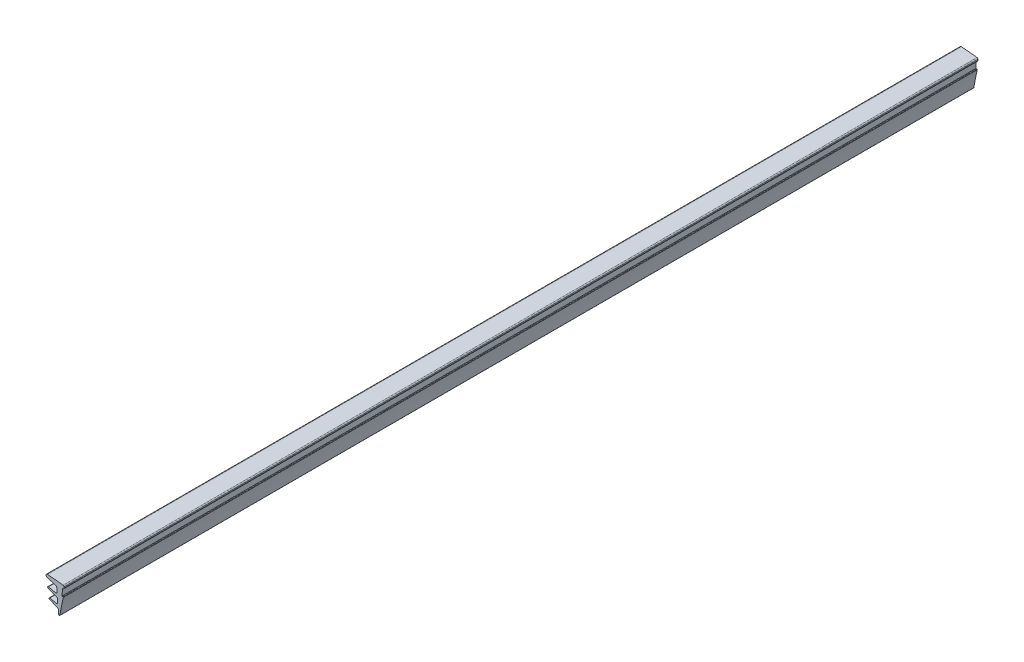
ISO-10303-21;
HEADER;
FILE_DESCRIPTION(('STEP AP214'),'2;1');
FILE_NAME('part.step','',(''),(''),'','','');
FILE_SCHEMA(('AUTOMOTIVE_DESIGN { 1 0 10303 214 1 1 1 1 }'));
ENDSEC;
DATA;
#1=APPLICATION_CONTEXT('core data for automotive mechanical design processes');
#2=APPLICATION_PROTOCOL_DEFINITION('international standard','automotive_design',2000,#1);
#3=PRODUCT_CONTEXT('',#1,'mechanical');
#4=PRODUCT('Part','Part','',(#3));
#5=PRODUCT_RELATED_PRODUCT_CATEGORY('part','',(#4));
#6=PRODUCT_DEFINITION_FORMATION('','',#4);
#7=PRODUCT_DEFINITION_CONTEXT('part definition',#1,'design');
#8=PRODUCT_DEFINITION('design','',#6,#7);
#9=PRODUCT_DEFINITION_SHAPE('','',#8);
#10=(LENGTH_UNIT() NAMED_UNIT(*) SI_UNIT(.MILLI.,.METRE.));
#11=(NAMED_UNIT(*) PLANE_ANGLE_UNIT() SI_UNIT($,.RADIAN.));
#12=(NAMED_UNIT(*) SI_UNIT($,.STERADIAN.) SOLID_ANGLE_UNIT());
#13=UNCERTAINTY_MEASURE_WITH_UNIT(LENGTH_MEASURE(1.E-05),#10,'distance_accuracy_value','');
#14=(GEOMETRIC_REPRESENTATION_CONTEXT(3) GLOBAL_UNCERTAINTY_ASSIGNED_CONTEXT((#13)) GLOBAL_UNIT_ASSIGNED_CONTEXT((#10,
#11,#12)) REPRESENTATION_CONTEXT('',''));
#15=CARTESIAN_POINT('',(0.,0.,0.));
#16=DIRECTION('',(0.,0.,1.));
#17=DIRECTION('',(1.,0.,0.));
#18=AXIS2_PLACEMENT_3D('',#15,#16,#17);
#19=CARTESIAN_POINT('',(2.32651293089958,2.35302451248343,-300.));
#20=DIRECTION('',(0.,0.,1.));
#21=DIRECTION('',(1.,0.,0.));
#22=AXIS2_PLACEMENT_3D('',#19,#20,#21);
#23=CYLINDRICAL_SURFACE('',#22,0.349999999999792);
#24=CARTESIAN_POINT('',(2.32651293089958,2.35302451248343,0.));
#25=DIRECTION('',(0.,0.,1.));
#26=DIRECTION('',(1.,0.,0.));
#27=AXIS2_PLACEMENT_3D('',#24,#25,#26);
#28=CIRCLE('',#27,0.349999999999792);
#29=CARTESIAN_POINT('',(2.37536265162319,2.00645027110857,0.));
#30=VERTEX_POINT('',#29);
#31=CARTESIAN_POINT('',(2.67607026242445,2.33542701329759,0.));
#32=VERTEX_POINT('',#31);
#33=EDGE_CURVE('E254',#30,#32,#28,.T.);
#34=ORIENTED_EDGE('',*,*,#33,.F.);
#35=DIRECTION('',(0.,0.,1.));
#36=VECTOR('',#35,1.);
#37=CARTESIAN_POINT('',(2.37536265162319,2.00645027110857,-300.));
#38=LINE('',#37,#36);
#39=CARTESIAN_POINT('',(2.37536265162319,2.00645027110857,-300.));
#40=VERTEX_POINT('',#39);
#41=EDGE_CURVE('E11',#40,#30,#38,.T.);
#42=ORIENTED_EDGE('',*,*,#41,.F.);
#43=CARTESIAN_POINT('',(2.32651293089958,2.35302451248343,-300.));
#44=DIRECTION('',(0.,0.,1.));
#45=DIRECTION('',(1.,0.,0.));
#46=AXIS2_PLACEMENT_3D('',#43,#44,#45);
#47=CIRCLE('',#46,0.349999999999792);
#48=CARTESIAN_POINT('',(2.67607026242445,2.33542701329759,-300.));
#49=VERTEX_POINT('',#48);
#50=EDGE_CURVE('E334',#40,#49,#47,.T.);
#51=ORIENTED_EDGE('',*,*,#50,.T.);
#52=DIRECTION('',(0.,0.,1.));
#53=VECTOR('',#52,1.);
#54=CARTESIAN_POINT('',(2.67607026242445,2.33542701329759,-300.));
#55=LINE('',#54,#53);
#56=EDGE_CURVE('E40',#49,#32,#55,.T.);
#57=ORIENTED_EDGE('',*,*,#56,.T.);
#58=EDGE_LOOP('',(#34,#42,#51,#57));
#59=FACE_BOUND('',#58,.T.);
#60=ADVANCED_FACE('F37',(#59),#23,.T.);
#61=CARTESIAN_POINT('',(2.34520814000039,2.00219998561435,-300.));
#62=DIRECTION('',(0.139570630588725,-0.990212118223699,0.));
#63=DIRECTION('',(0.9902121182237,0.139570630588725,0.));
#64=AXIS2_PLACEMENT_3D('',#61,#62,#63);
#65=PLANE('',#64);
#66=DIRECTION('',(0.990212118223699,0.139570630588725,0.));
#67=VECTOR('',#66,1.);
#68=CARTESIAN_POINT('',(2.34520814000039,2.00219998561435,0.));
#69=LINE('',#68,#67);
#70=CARTESIAN_POINT('',(2.34520814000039,2.00219998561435,0.));
#71=VERTEX_POINT('',#70);
#72=EDGE_CURVE('E332',#71,#30,#69,.T.);
#73=ORIENTED_EDGE('',*,*,#72,.F.);
#74=DIRECTION('',(0.,0.,1.));
#75=VECTOR('',#74,1.);
#76=CARTESIAN_POINT('',(2.34520814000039,2.00219998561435,-300.));
#77=LINE('',#76,#75);
#78=CARTESIAN_POINT('',(2.34520814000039,2.00219998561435,-300.));
#79=VERTEX_POINT('',#78);
#80=EDGE_CURVE('E46',#79,#71,#77,.T.);
#81=ORIENTED_EDGE('',*,*,#80,.F.);
#82=DIRECTION('',(0.990212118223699,0.139570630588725,0.));
#83=VECTOR('',#82,1.);
#84=CARTESIAN_POINT('',(2.34520814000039,2.00219998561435,-300.));
#85=LINE('',#84,#83);
#86=EDGE_CURVE('E244',#79,#40,#85,.T.);
#87=ORIENTED_EDGE('',*,*,#86,.T.);
#88=ORIENTED_EDGE('',*,*,#41,.T.);
#89=EDGE_LOOP('',(#73,#81,#87,#88));
#90=FACE_BOUND('',#89,.T.);
#91=ADVANCED_FACE('F386',(#90),#65,.T.);
#92=CARTESIAN_POINT('',(2.38010079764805,1.7546469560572,-300.));
#93=DIRECTION('',(0.,0.,1.));
#94=DIRECTION('',(1.,0.,0.));
#95=AXIS2_PLACEMENT_3D('',#92,#93,#94);
#96=CYLINDRICAL_SURFACE('',#95,0.250000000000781);
#97=CARTESIAN_POINT('',(2.38010079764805,1.7546469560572,0.));
#98=DIRECTION('',(0.,0.,-1.));
#99=DIRECTION('',(1.,0.,0.));
#100=AXIS2_PLACEMENT_3D('',#97,#98,#99);
#101=CIRCLE('',#100,0.250000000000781);
#102=CARTESIAN_POINT('',(2.13024308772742,1.76308050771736,0.));
#103=VERTEX_POINT('',#102);
#104=EDGE_CURVE('E231',#103,#71,#101,.T.);
#105=ORIENTED_EDGE('',*,*,#104,.F.);
#106=DIRECTION('',(0.,0.,1.));
#107=VECTOR('',#106,1.);
#108=CARTESIAN_POINT('',(2.13024308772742,1.76308050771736,-300.));
#109=LINE('',#108,#107);
#110=CARTESIAN_POINT('',(2.13024308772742,1.76308050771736,-300.));
#111=VERTEX_POINT('',#110);
#112=EDGE_CURVE('E226',#111,#103,#109,.T.);
#113=ORIENTED_EDGE('',*,*,#112,.F.);
#114=CARTESIAN_POINT('',(2.38010079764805,1.7546469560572,-300.));
#115=DIRECTION('',(0.,0.,-1.));
#116=DIRECTION('',(1.,0.,0.));
#117=AXIS2_PLACEMENT_3D('',#114,#115,#116);
#118=CIRCLE('',#117,0.250000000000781);
#119=EDGE_CURVE('E229',#111,#79,#118,.T.);
#120=ORIENTED_EDGE('',*,*,#119,.T.);
#121=ORIENTED_EDGE('',*,*,#80,.T.);
#122=EDGE_LOOP('',(#105,#113,#120,#121));
#123=FACE_BOUND('',#122,.T.);
#124=ADVANCED_FACE('F228',(#123),#96,.F.);
#125=CARTESIAN_POINT('',(2.06454579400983,-0.183308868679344,-300.));
#126=DIRECTION('',(0.999430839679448,-0.0337342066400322,0.));
#127=DIRECTION('',(0.0337342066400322,0.999430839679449,0.));
#128=AXIS2_PLACEMENT_3D('',#125,#126,#127);
#129=PLANE('',#128);
#130=DIRECTION('',(0.0337342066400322,0.999430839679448,0.));
#131=VECTOR('',#130,1.);
#132=CARTESIAN_POINT('',(2.06454579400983,-0.183308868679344,0.));
#133=LINE('',#132,#131);
#134=CARTESIAN_POINT('',(2.06454579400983,-0.183308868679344,0.));
#135=VERTEX_POINT('',#134);
#136=EDGE_CURVE('E329',#135,#103,#133,.T.);
#137=ORIENTED_EDGE('',*,*,#136,.F.);
#138=DIRECTION('',(0.,0.,1.));
#139=VECTOR('',#138,1.);
#140=CARTESIAN_POINT('',(2.06454579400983,-0.183308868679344,-300.));
#141=LINE('',#140,#139);
#142=CARTESIAN_POINT('',(2.06454579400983,-0.183308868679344,-300.));
#143=VERTEX_POINT('',#142);
#144=EDGE_CURVE('E236',#143,#135,#141,.T.);
#145=ORIENTED_EDGE('',*,*,#144,.F.);
#146=DIRECTION('',(0.0337342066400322,0.999430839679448,0.));
#147=VECTOR('',#146,1.);
#148=CARTESIAN_POINT('',(2.06454579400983,-0.183308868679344,-300.));
#149=LINE('',#148,#147);
#150=EDGE_CURVE('E242',#143,#111,#149,.T.);
#151=ORIENTED_EDGE('',*,*,#150,.T.);
#152=ORIENTED_EDGE('',*,*,#112,.T.);
#153=EDGE_LOOP('',(#137,#145,#151,#152));
#154=FACE_BOUND('',#153,.T.);
#155=ADVANCED_FACE('F246',(#154),#129,.T.);
#156=CARTESIAN_POINT('',(2.16448887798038,-0.186682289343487,-300.));
#157=DIRECTION('',(0.,0.,1.));
#158=DIRECTION('',(1.,0.,0.));
#159=AXIS2_PLACEMENT_3D('',#156,#157,#158);
#160=CYLINDRICAL_SURFACE('',#159,0.100000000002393);
#161=CARTESIAN_POINT('',(2.16448887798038,-0.186682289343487,0.));
#162=DIRECTION('',(0.,0.,-1.));
#163=DIRECTION('',(1.,0.,0.));
#164=AXIS2_PLACEMENT_3D('',#161,#162,#163);
#165=CIRCLE('',#164,0.100000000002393);
#166=CARTESIAN_POINT('',(2.16646422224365,-0.286662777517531,0.));
#167=VERTEX_POINT('',#166);
#168=EDGE_CURVE('E326',#167,#135,#165,.T.);
#169=ORIENTED_EDGE('',*,*,#168,.F.);
#170=DIRECTION('',(0.,0.,1.));
#171=VECTOR('',#170,1.);
#172=CARTESIAN_POINT('',(2.16646422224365,-0.286662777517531,-300.));
#173=LINE('',#172,#171);
#174=CARTESIAN_POINT('',(2.16646422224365,-0.286662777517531,-300.));
#175=VERTEX_POINT('',#174);
#176=EDGE_CURVE('E338',#175,#167,#173,.T.);
#177=ORIENTED_EDGE('',*,*,#176,.F.);
#178=CARTESIAN_POINT('',(2.16448887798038,-0.186682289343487,-300.));
#179=DIRECTION('',(0.,0.,-1.));
#180=DIRECTION('',(1.,0.,0.));
#181=AXIS2_PLACEMENT_3D('',#178,#179,#180);
#182=CIRCLE('',#181,0.100000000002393);
#183=EDGE_CURVE('E247',#175,#143,#182,.T.);
#184=ORIENTED_EDGE('',*,*,#183,.T.);
#185=ORIENTED_EDGE('',*,*,#144,.T.);
#186=EDGE_LOOP('',(#169,#177,#184,#185));
#187=FACE_BOUND('',#186,.T.);
#188=ADVANCED_FACE('F399',(#187),#160,.F.);
#189=CARTESIAN_POINT('',(2.36575350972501,-0.282725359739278,-300.));
#190=DIRECTION('',(-0.0197534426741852,0.999804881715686,0.));
#191=DIRECTION('',(-0.999804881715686,-0.0197534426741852,0.));
#192=AXIS2_PLACEMENT_3D('',#189,#190,#191);
#193=PLANE('',#192);
#194=DIRECTION('',(-0.999804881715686,-0.0197534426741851,0.));
#195=VECTOR('',#194,1.);
#196=CARTESIAN_POINT('',(2.36575350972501,-0.282725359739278,0.));
#197=LINE('',#196,#195);
#198=CARTESIAN_POINT('',(2.36575350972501,-0.282725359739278,0.));
#199=VERTEX_POINT('',#198);
#200=EDGE_CURVE('E323',#199,#167,#197,.T.);
#201=ORIENTED_EDGE('',*,*,#200,.F.);
#202=DIRECTION('',(0.,0.,1.));
#203=VECTOR('',#202,1.);
#204=CARTESIAN_POINT('',(2.36575350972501,-0.282725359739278,-300.));
#205=LINE('',#204,#203);
#206=CARTESIAN_POINT('',(2.36575350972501,-0.282725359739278,-300.));
#207=VERTEX_POINT('',#206);
#208=EDGE_CURVE('E340',#207,#199,#205,.T.);
#209=ORIENTED_EDGE('',*,*,#208,.F.);
#210=DIRECTION('',(-0.999804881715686,-0.0197534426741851,0.));
#211=VECTOR('',#210,1.);
#212=CARTESIAN_POINT('',(2.36575350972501,-0.282725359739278,-300.));
#213=LINE('',#212,#211);
#214=EDGE_CURVE('E249',#207,#175,#213,.T.);
#215=ORIENTED_EDGE('',*,*,#214,.T.);
#216=ORIENTED_EDGE('',*,*,#176,.T.);
#217=EDGE_LOOP('',(#201,#209,#215,#216));
#218=FACE_BOUND('',#217,.T.);
#219=ADVANCED_FACE('F402',(#218),#193,.T.);
#220=CARTESIAN_POINT('',(2.36772885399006,-0.382705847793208,-300.));
#221=DIRECTION('',(0.,0.,1.));
#222=DIRECTION('',(1.,0.,0.));
#223=AXIS2_PLACEMENT_3D('',#220,#221,#222);
#224=CYLINDRICAL_SURFACE('',#223,0.0999999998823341);
#225=CARTESIAN_POINT('',(2.36772885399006,-0.382705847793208,0.));
#226=DIRECTION('',(0.,0.,1.));
#227=DIRECTION('',(1.,0.,0.));
#228=AXIS2_PLACEMENT_3D('',#225,#226,#227);
#229=CIRCLE('',#228,0.0999999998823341);
#230=CARTESIAN_POINT('',(2.46747341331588,-0.38984887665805,0.));
#231=VERTEX_POINT('',#230);
#232=EDGE_CURVE('E320',#231,#199,#229,.T.);
#233=ORIENTED_EDGE('',*,*,#232,.F.);
#234=DIRECTION('',(0.,0.,1.));
#235=VECTOR('',#234,1.);
#236=CARTESIAN_POINT('',(2.46747341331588,-0.38984887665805,-300.));
#237=LINE('',#236,#235);
#238=CARTESIAN_POINT('',(2.46747341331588,-0.38984887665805,-300.));
#239=VERTEX_POINT('',#238);
#240=EDGE_CURVE('E342',#239,#231,#237,.T.);
#241=ORIENTED_EDGE('',*,*,#240,.F.);
#242=CARTESIAN_POINT('',(2.36772885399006,-0.382705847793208,-300.));
#243=DIRECTION('',(0.,0.,1.));
#244=DIRECTION('',(1.,0.,0.));
#245=AXIS2_PLACEMENT_3D('',#242,#243,#244);
#246=CIRCLE('',#245,0.0999999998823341);
#247=EDGE_CURVE('E747',#239,#207,#246,.T.);
#248=ORIENTED_EDGE('',*,*,#247,.T.);
#249=ORIENTED_EDGE('',*,*,#208,.T.);
#250=EDGE_LOOP('',(#233,#241,#248,#249));
#251=FACE_BOUND('',#250,.T.);
#252=ADVANCED_FACE('F406',(#251),#224,.T.);
#253=CARTESIAN_POINT('',(118.333943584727,-26.9163243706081,-300.));
#254=DIRECTION('',(0.,0.,1.));
#255=DIRECTION('',(1.,0.,0.));
#256=AXIS2_PLACEMENT_3D('',#253,#254,#255);
#257=CYLINDRICAL_SURFACE('',#256,118.864178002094);
#258=CARTESIAN_POINT('',(118.333943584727,-26.9163243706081,0.));
#259=DIRECTION('',(0.,0.,-1.));
#260=DIRECTION('',(1.,0.,0.));
#261=AXIS2_PLACEMENT_3D('',#258,#259,#260);
#262=CIRCLE('',#261,118.864178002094);
#263=CARTESIAN_POINT('',(1.30619951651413,-6.10286885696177,0.));
#264=VERTEX_POINT('',#263);
#265=EDGE_CURVE('E317',#264,#231,#262,.T.);
#266=ORIENTED_EDGE('',*,*,#265,.F.);
#267=DIRECTION('',(0.,0.,1.));
#268=VECTOR('',#267,1.);
#269=CARTESIAN_POINT('',(1.30619951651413,-6.10286885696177,-300.));
#270=LINE('',#269,#268);
#271=CARTESIAN_POINT('',(1.30619951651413,-6.10286885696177,-300.));
#272=VERTEX_POINT('',#271);
#273=EDGE_CURVE('E344',#272,#264,#270,.T.);
#274=ORIENTED_EDGE('',*,*,#273,.F.);
#275=CARTESIAN_POINT('',(118.333943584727,-26.9163243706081,-300.));
#276=DIRECTION('',(0.,0.,-1.));
#277=DIRECTION('',(1.,0.,0.));
#278=AXIS2_PLACEMENT_3D('',#275,#276,#277);
#279=CIRCLE('',#278,118.864178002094);
#280=EDGE_CURVE('E743',#272,#239,#279,.T.);
#281=ORIENTED_EDGE('',*,*,#280,.T.);
#282=ORIENTED_EDGE('',*,*,#240,.T.);
#283=EDGE_LOOP('',(#266,#274,#281,#282));
#284=FACE_BOUND('',#283,.T.);
#285=ADVANCED_FACE('F410',(#284),#257,.F.);
#286=CARTESIAN_POINT('',(1.12569486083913,-6.01674064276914,-300.));
#287=DIRECTION('',(0.,0.,1.));
#288=DIRECTION('',(1.,0.,0.));
#289=AXIS2_PLACEMENT_3D('',#286,#287,#288);
#290=CYLINDRICAL_SURFACE('',#289,0.200000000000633);
#291=CARTESIAN_POINT('',(1.12569486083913,-6.01674064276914,0.));
#292=DIRECTION('',(0.,0.,1.));
#293=DIRECTION('',(1.,0.,0.));
#294=AXIS2_PLACEMENT_3D('',#291,#292,#293);
#295=CIRCLE('',#294,0.200000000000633);
#296=CARTESIAN_POINT('',(0.926299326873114,-6.03227837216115,0.));
#297=VERTEX_POINT('',#296);
#298=EDGE_CURVE('E314',#297,#264,#295,.T.);
#299=ORIENTED_EDGE('',*,*,#298,.F.);
#300=DIRECTION('',(0.,0.,1.));
#301=VECTOR('',#300,1.);
#302=CARTESIAN_POINT('',(0.926299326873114,-6.03227837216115,-300.));
#303=LINE('',#302,#301);
#304=CARTESIAN_POINT('',(0.926299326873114,-6.03227837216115,-300.));
#305=VERTEX_POINT('',#304);
#306=EDGE_CURVE('E346',#305,#297,#303,.T.);
#307=ORIENTED_EDGE('',*,*,#306,.F.);
#308=CARTESIAN_POINT('',(1.12569486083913,-6.01674064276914,-300.));
#309=DIRECTION('',(0.,0.,1.));
#310=DIRECTION('',(1.,0.,0.));
#311=AXIS2_PLACEMENT_3D('',#308,#309,#310);
#312=CIRCLE('',#311,0.200000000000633);
#313=EDGE_CURVE('E754',#305,#272,#312,.T.);
#314=ORIENTED_EDGE('',*,*,#313,.T.);
#315=ORIENTED_EDGE('',*,*,#273,.T.);
#316=EDGE_LOOP('',(#299,#307,#314,#315));
#317=FACE_BOUND('',#316,.T.);
#318=ADVANCED_FACE('F414',(#317),#290,.T.);
#319=CARTESIAN_POINT('',(0.818437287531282,-4.64808584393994,-300.));
#320=DIRECTION('',(-0.996977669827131,-0.0776886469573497,0.));
#321=DIRECTION('',(0.0776886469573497,-0.996977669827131,0.));
#322=AXIS2_PLACEMENT_3D('',#319,#320,#321);
#323=PLANE('',#322);
#324=DIRECTION('',(0.0776886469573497,-0.996977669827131,0.));
#325=VECTOR('',#324,1.);
#326=CARTESIAN_POINT('',(0.818437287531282,-4.64808584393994,0.));
#327=LINE('',#326,#325);
#328=CARTESIAN_POINT('',(0.818437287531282,-4.64808584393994,0.));
#329=VERTEX_POINT('',#328);
#330=EDGE_CURVE('E311',#329,#297,#327,.T.);
#331=ORIENTED_EDGE('',*,*,#330,.F.);
#332=DIRECTION('',(0.,0.,1.));
#333=VECTOR('',#332,1.);
#334=CARTESIAN_POINT('',(0.818437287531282,-4.64808584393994,-300.));
#335=LINE('',#334,#333);
#336=CARTESIAN_POINT('',(0.818437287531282,-4.64808584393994,-300.));
#337=VERTEX_POINT('',#336);
#338=EDGE_CURVE('E348',#337,#329,#335,.T.);
#339=ORIENTED_EDGE('',*,*,#338,.F.);
#340=DIRECTION('',(0.0776886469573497,-0.996977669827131,0.));
#341=VECTOR('',#340,1.);
#342=CARTESIAN_POINT('',(0.818437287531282,-4.64808584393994,-300.));
#343=LINE('',#342,#341);
#344=EDGE_CURVE('E736',#337,#305,#343,.T.);
#345=ORIENTED_EDGE('',*,*,#344,.T.);
#346=ORIENTED_EDGE('',*,*,#306,.T.);
#347=EDGE_LOOP('',(#331,#339,#345,#346));
#348=FACE_BOUND('',#347,.T.);
#349=ADVANCED_FACE('F418',(#348),#323,.T.);
#350=CARTESIAN_POINT('',(0.419646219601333,-4.67916130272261,-300.));
#351=DIRECTION('',(0.,0.,1.));
#352=DIRECTION('',(1.,0.,0.));
#353=AXIS2_PLACEMENT_3D('',#350,#351,#352);
#354=CYLINDRICAL_SURFACE('',#353,0.399999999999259);
#355=CARTESIAN_POINT('',(0.419646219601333,-4.67916130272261,0.));
#356=DIRECTION('',(0.,0.,-1.));
#357=DIRECTION('',(1.,0.,0.));
#358=AXIS2_PLACEMENT_3D('',#355,#356,#357);
#359=CIRCLE('',#358,0.399999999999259);
#360=CARTESIAN_POINT('',(0.515751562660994,-4.29087820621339,0.));
#361=VERTEX_POINT('',#360);
#362=EDGE_CURVE('E308',#361,#329,#359,.T.);
#363=ORIENTED_EDGE('',*,*,#362,.F.);
#364=DIRECTION('',(0.,0.,1.));
#365=VECTOR('',#364,1.);
#366=CARTESIAN_POINT('',(0.515751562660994,-4.29087820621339,-300.));
#367=LINE('',#366,#365);
#368=CARTESIAN_POINT('',(0.515751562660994,-4.29087820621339,-300.));
#369=VERTEX_POINT('',#368);
#370=EDGE_CURVE('E350',#369,#361,#367,.T.);
#371=ORIENTED_EDGE('',*,*,#370,.F.);
#372=CARTESIAN_POINT('',(0.419646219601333,-4.67916130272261,-300.));
#373=DIRECTION('',(0.,0.,-1.));
#374=DIRECTION('',(1.,0.,0.));
#375=AXIS2_PLACEMENT_3D('',#372,#373,#374);
#376=CIRCLE('',#375,0.399999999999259);
#377=EDGE_CURVE('E732',#369,#337,#376,.T.);
#378=ORIENTED_EDGE('',*,*,#377,.T.);
#379=ORIENTED_EDGE('',*,*,#338,.T.);
#380=EDGE_LOOP('',(#363,#371,#378,#379));
#381=FACE_BOUND('',#380,.T.);
#382=ADVANCED_FACE('F422',(#381),#354,.F.);
#383=CARTESIAN_POINT('',(-2.07591233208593,-3.22775044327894,-300.));
#384=DIRECTION('',(-0.379520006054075,-0.925183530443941,0.));
#385=DIRECTION('',(0.925183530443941,-0.379520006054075,0.));
#386=AXIS2_PLACEMENT_3D('',#383,#384,#385);
#387=PLANE('',#386);
#388=DIRECTION('',(0.925183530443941,-0.379520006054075,0.));
#389=VECTOR('',#388,1.);
#390=CARTESIAN_POINT('',(-2.07591233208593,-3.22775044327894,0.));
#391=LINE('',#390,#389);
#392=CARTESIAN_POINT('',(-2.07591233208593,-3.22775044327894,0.));
#393=VERTEX_POINT('',#392);
#394=EDGE_CURVE('E305',#393,#361,#391,.T.);
#395=ORIENTED_EDGE('',*,*,#394,.F.);
#396=DIRECTION('',(0.,0.,1.));
#397=VECTOR('',#396,1.);
#398=CARTESIAN_POINT('',(-2.07591233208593,-3.22775044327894,-300.));
#399=LINE('',#398,#397);
#400=CARTESIAN_POINT('',(-2.07591233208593,-3.22775044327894,-300.));
#401=VERTEX_POINT('',#400);
#402=EDGE_CURVE('E352',#401,#393,#399,.T.);
#403=ORIENTED_EDGE('',*,*,#402,.F.);
#404=DIRECTION('',(0.925183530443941,-0.379520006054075,0.));
#405=VECTOR('',#404,1.);
#406=CARTESIAN_POINT('',(-2.07591233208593,-3.22775044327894,-300.));
#407=LINE('',#406,#405);
#408=EDGE_CURVE('E758',#401,#369,#407,.T.);
#409=ORIENTED_EDGE('',*,*,#408,.T.);
#410=ORIENTED_EDGE('',*,*,#370,.T.);
#411=EDGE_LOOP('',(#395,#403,#409,#410));
#412=FACE_BOUND('',#411,.T.);
#413=ADVANCED_FACE('F426',(#412),#387,.T.);
#414=CARTESIAN_POINT('',(-1.98103233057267,-2.99645456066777,-300.));
#415=DIRECTION('',(0.,0.,1.));
#416=DIRECTION('',(1.,0.,0.));
#417=AXIS2_PLACEMENT_3D('',#414,#415,#416);
#418=CYLINDRICAL_SURFACE('',#417,0.250000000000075);
#419=CARTESIAN_POINT('',(-1.98103233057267,-2.99645456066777,0.));
#420=DIRECTION('',(0.,0.,1.));
#421=DIRECTION('',(1.,0.,0.));
#422=AXIS2_PLACEMENT_3D('',#419,#420,#421);
#423=CIRCLE('',#422,0.250000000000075);
#424=CARTESIAN_POINT('',(-1.92096649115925,-2.75377762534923,0.));
#425=VERTEX_POINT('',#424);
#426=EDGE_CURVE('E302',#425,#393,#423,.T.);
#427=ORIENTED_EDGE('',*,*,#426,.F.);
#428=DIRECTION('',(0.,0.,1.));
#429=VECTOR('',#428,1.);
#430=CARTESIAN_POINT('',(-1.92096649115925,-2.75377762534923,-300.));
#431=LINE('',#430,#429);
#432=CARTESIAN_POINT('',(-1.92096649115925,-2.75377762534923,-300.));
#433=VERTEX_POINT('',#432);
#434=EDGE_CURVE('E354',#433,#425,#431,.T.);
#435=ORIENTED_EDGE('',*,*,#434,.F.);
#436=CARTESIAN_POINT('',(-1.98103233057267,-2.99645456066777,-300.));
#437=DIRECTION('',(0.,0.,1.));
#438=DIRECTION('',(1.,0.,0.));
#439=AXIS2_PLACEMENT_3D('',#436,#437,#438);
#440=CIRCLE('',#439,0.250000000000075);
#441=EDGE_CURVE('E725',#433,#401,#440,.T.);
#442=ORIENTED_EDGE('',*,*,#441,.T.);
#443=ORIENTED_EDGE('',*,*,#402,.T.);
#444=EDGE_LOOP('',(#427,#435,#442,#443));
#445=FACE_BOUND('',#444,.T.);
#446=ADVANCED_FACE('F430',(#445),#418,.T.);
#447=CARTESIAN_POINT('',(0.127737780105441,-3.26085977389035,-300.));
#448=DIRECTION('',(0.240263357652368,0.970707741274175,0.));
#449=DIRECTION('',(-0.970707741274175,0.240263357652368,0.));
#450=AXIS2_PLACEMENT_3D('',#447,#448,#449);
#451=PLANE('',#450);
#452=DIRECTION('',(-0.970707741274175,0.240263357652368,0.));
#453=VECTOR('',#452,1.);
#454=CARTESIAN_POINT('',(0.127737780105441,-3.26085977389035,0.));
#455=LINE('',#454,#453);
#456=CARTESIAN_POINT('',(0.127737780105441,-3.26085977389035,0.));
#457=VERTEX_POINT('',#456);
#458=EDGE_CURVE('E299',#457,#425,#455,.T.);
#459=ORIENTED_EDGE('',*,*,#458,.F.);
#460=DIRECTION('',(0.,0.,1.));
#461=VECTOR('',#460,1.);
#462=CARTESIAN_POINT('',(0.127737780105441,-3.26085977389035,-300.));
#463=LINE('',#462,#461);
#464=CARTESIAN_POINT('',(0.127737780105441,-3.26085977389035,-300.));
#465=VERTEX_POINT('',#464);
#466=EDGE_CURVE('E356',#465,#457,#463,.T.);
#467=ORIENTED_EDGE('',*,*,#466,.F.);
#468=DIRECTION('',(-0.970707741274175,0.240263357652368,0.));
#469=VECTOR('',#468,1.);
#470=CARTESIAN_POINT('',(0.127737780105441,-3.26085977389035,-300.));
#471=LINE('',#470,#469);
#472=EDGE_CURVE('E721',#465,#433,#471,.T.);
#473=ORIENTED_EDGE('',*,*,#472,.T.);
#474=ORIENTED_EDGE('',*,*,#434,.T.);
#475=EDGE_LOOP('',(#459,#467,#473,#474));
#476=FACE_BOUND('',#475,.T.);
#477=ADVANCED_FACE('F434',(#476),#451,.T.);
#478=CARTESIAN_POINT('',(0.223843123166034,-2.87257667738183,-300.));
#479=DIRECTION('',(0.,0.,1.));
#480=DIRECTION('',(1.,0.,0.));
#481=AXIS2_PLACEMENT_3D('',#478,#479,#480);
#482=CYLINDRICAL_SURFACE('',#481,0.399999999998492);
#483=CARTESIAN_POINT('',(0.223843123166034,-2.87257667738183,0.));
#484=DIRECTION('',(0.,0.,-1.));
#485=DIRECTION('',(1.,0.,0.));
#486=AXIS2_PLACEMENT_3D('',#483,#484,#485);
#487=CIRCLE('',#486,0.399999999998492);
#488=CARTESIAN_POINT('',(0.622634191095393,-2.84150121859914,0.));
#489=VERTEX_POINT('',#488);
#490=EDGE_CURVE('E296',#489,#457,#487,.T.);
#491=ORIENTED_EDGE('',*,*,#490,.F.);
#492=DIRECTION('',(0.,0.,1.));
#493=VECTOR('',#492,1.);
#494=CARTESIAN_POINT('',(0.622634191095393,-2.84150121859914,-300.));
#495=LINE('',#494,#493);
#496=CARTESIAN_POINT('',(0.622634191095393,-2.84150121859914,-300.));
#497=VERTEX_POINT('',#496);
#498=EDGE_CURVE('E358',#497,#489,#495,.T.);
#499=ORIENTED_EDGE('',*,*,#498,.F.);
#500=CARTESIAN_POINT('',(0.223843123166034,-2.87257667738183,-300.));
#501=DIRECTION('',(0.,0.,-1.));
#502=DIRECTION('',(1.,0.,0.));
#503=AXIS2_PLACEMENT_3D('',#500,#501,#502);
#504=CIRCLE('',#503,0.399999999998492);
#505=EDGE_CURVE('E762',#497,#465,#504,.T.);
#506=ORIENTED_EDGE('',*,*,#505,.T.);
#507=ORIENTED_EDGE('',*,*,#466,.T.);
#508=EDGE_LOOP('',(#491,#499,#506,#507));
#509=FACE_BOUND('',#508,.T.);
#510=ADVANCED_FACE('F438',(#509),#482,.F.);
#511=CARTESIAN_POINT('',(0.538485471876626,-1.76162150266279,-300.));
#512=DIRECTION('',(-0.996977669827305,-0.0776886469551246,0.));
#513=DIRECTION('',(0.0776886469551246,-0.996977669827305,0.));
#514=AXIS2_PLACEMENT_3D('',#511,#512,#513);
#515=PLANE('',#514);
#516=DIRECTION('',(0.0776886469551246,-0.996977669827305,0.));
#517=VECTOR('',#516,1.);
#518=CARTESIAN_POINT('',(0.538485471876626,-1.76162150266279,0.));
#519=LINE('',#518,#517);
#520=CARTESIAN_POINT('',(0.538485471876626,-1.76162150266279,0.));
#521=VERTEX_POINT('',#520);
#522=EDGE_CURVE('E293',#521,#489,#519,.T.);
#523=ORIENTED_EDGE('',*,*,#522,.F.);
#524=DIRECTION('',(0.,0.,1.));
#525=VECTOR('',#524,1.);
#526=CARTESIAN_POINT('',(0.538485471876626,-1.76162150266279,-300.));
#527=LINE('',#526,#525);
#528=CARTESIAN_POINT('',(0.538485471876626,-1.76162150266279,-300.));
#529=VERTEX_POINT('',#528);
#530=EDGE_CURVE('E360',#529,#521,#527,.T.);
#531=ORIENTED_EDGE('',*,*,#530,.F.);
#532=DIRECTION('',(0.0776886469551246,-0.996977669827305,0.));
#533=VECTOR('',#532,1.);
#534=CARTESIAN_POINT('',(0.538485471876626,-1.76162150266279,-300.));
#535=LINE('',#534,#533);
#536=EDGE_CURVE('E714',#529,#497,#535,.T.);
#537=ORIENTED_EDGE('',*,*,#536,.T.);
#538=ORIENTED_EDGE('',*,*,#498,.T.);
#539=EDGE_LOOP('',(#523,#531,#537,#538));
#540=FACE_BOUND('',#539,.T.);
#541=ADVANCED_FACE('F442',(#540),#515,.T.);
#542=CARTESIAN_POINT('',(0.139694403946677,-1.79269696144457,-300.));
#543=DIRECTION('',(0.,0.,1.));
#544=DIRECTION('',(1.,0.,0.));
#545=AXIS2_PLACEMENT_3D('',#542,#543,#544);
#546=CYLINDRICAL_SURFACE('',#545,0.399999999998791);
#547=CARTESIAN_POINT('',(0.139694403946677,-1.79269696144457,0.));
#548=DIRECTION('',(0.,0.,-1.));
#549=DIRECTION('',(1.,0.,0.));
#550=AXIS2_PLACEMENT_3D('',#547,#548,#549);
#551=CIRCLE('',#550,0.399999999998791);
#552=CARTESIAN_POINT('',(0.235799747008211,-1.40441386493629,0.));
#553=VERTEX_POINT('',#552);
#554=EDGE_CURVE('E290',#553,#521,#551,.T.);
#555=ORIENTED_EDGE('',*,*,#554,.F.);
#556=DIRECTION('',(0.,0.,1.));
#557=VECTOR('',#556,1.);
#558=CARTESIAN_POINT('',(0.235799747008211,-1.40441386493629,-300.));
#559=LINE('',#558,#557);
#560=CARTESIAN_POINT('',(0.235799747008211,-1.40441386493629,-300.));
#561=VERTEX_POINT('',#560);
#562=EDGE_CURVE('E362',#561,#553,#559,.T.);
#563=ORIENTED_EDGE('',*,*,#562,.F.);
#564=CARTESIAN_POINT('',(0.139694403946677,-1.79269696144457,-300.));
#565=DIRECTION('',(0.,0.,-1.));
#566=DIRECTION('',(1.,0.,0.));
#567=AXIS2_PLACEMENT_3D('',#564,#565,#566);
#568=CIRCLE('',#567,0.399999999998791);
#569=EDGE_CURVE('E710',#561,#529,#568,.T.);
#570=ORIENTED_EDGE('',*,*,#569,.T.);
#571=ORIENTED_EDGE('',*,*,#530,.T.);
#572=EDGE_LOOP('',(#555,#563,#570,#571));
#573=FACE_BOUND('',#572,.T.);
#574=ADVANCED_FACE('F446',(#573),#546,.F.);
#575=CARTESIAN_POINT('',(-2.53895029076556,-0.296309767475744,-300.));
#576=DIRECTION('',(-0.370872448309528,-0.928683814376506,0.));
#577=DIRECTION('',(0.928683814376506,-0.370872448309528,0.));
#578=AXIS2_PLACEMENT_3D('',#575,#576,#577);
#579=PLANE('',#578);
#580=DIRECTION('',(0.928683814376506,-0.370872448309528,0.));
#581=VECTOR('',#580,1.);
#582=CARTESIAN_POINT('',(-2.53895029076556,-0.296309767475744,0.));
#583=LINE('',#582,#581);
#584=CARTESIAN_POINT('',(-2.53895029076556,-0.296309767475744,0.));
#585=VERTEX_POINT('',#584);
#586=EDGE_CURVE('E287',#585,#553,#583,.T.);
#587=ORIENTED_EDGE('',*,*,#586,.F.);
#588=DIRECTION('',(0.,0.,1.));
#589=VECTOR('',#588,1.);
#590=CARTESIAN_POINT('',(-2.53895029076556,-0.296309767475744,-300.));
#591=LINE('',#590,#589);
#592=CARTESIAN_POINT('',(-2.53895029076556,-0.296309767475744,-300.));
#593=VERTEX_POINT('',#592);
#594=EDGE_CURVE('E364',#593,#585,#591,.T.);
#595=ORIENTED_EDGE('',*,*,#594,.F.);
#596=DIRECTION('',(0.928683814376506,-0.370872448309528,0.));
#597=VECTOR('',#596,1.);
#598=CARTESIAN_POINT('',(-2.53895029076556,-0.296309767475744,-300.));
#599=LINE('',#598,#597);
#600=EDGE_CURVE('E766',#593,#561,#599,.T.);
#601=ORIENTED_EDGE('',*,*,#600,.T.);
#602=ORIENTED_EDGE('',*,*,#562,.T.);
#603=EDGE_LOOP('',(#587,#595,#601,#602));
#604=FACE_BOUND('',#603,.T.);
#605=ADVANCED_FACE('F450',(#604),#579,.T.);
#606=CARTESIAN_POINT('',(-2.44623217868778,-0.0641388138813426,-300.));
#607=DIRECTION('',(0.,0.,1.));
#608=DIRECTION('',(1.,0.,0.));
#609=AXIS2_PLACEMENT_3D('',#606,#607,#608);
#610=CYLINDRICAL_SURFACE('',#609,0.250000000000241);
#611=CARTESIAN_POINT('',(-2.44623217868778,-0.0641388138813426,0.));
#612=DIRECTION('',(0.,0.,1.));
#613=DIRECTION('',(1.,0.,0.));
#614=AXIS2_PLACEMENT_3D('',#611,#612,#613);
#615=CIRCLE('',#614,0.250000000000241);
#616=CARTESIAN_POINT('',(-2.38616633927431,0.178538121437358,0.));
#617=VERTEX_POINT('',#616);
#618=EDGE_CURVE('E284',#617,#585,#615,.T.);
#619=ORIENTED_EDGE('',*,*,#618,.F.);
#620=DIRECTION('',(0.,0.,1.));
#621=VECTOR('',#620,1.);
#622=CARTESIAN_POINT('',(-2.38616633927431,0.178538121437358,-300.));
#623=LINE('',#622,#621);
#624=CARTESIAN_POINT('',(-2.38616633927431,0.178538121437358,-300.));
#625=VERTEX_POINT('',#624);
#626=EDGE_CURVE('E366',#625,#617,#623,.T.);
#627=ORIENTED_EDGE('',*,*,#626,.F.);
#628=CARTESIAN_POINT('',(-2.44623217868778,-0.0641388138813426,-300.));
#629=DIRECTION('',(0.,0.,1.));
#630=DIRECTION('',(1.,0.,0.));
#631=AXIS2_PLACEMENT_3D('',#628,#629,#630);
#632=CIRCLE('',#631,0.250000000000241);
#633=EDGE_CURVE('E703',#625,#593,#632,.T.);
#634=ORIENTED_EDGE('',*,*,#633,.T.);
#635=ORIENTED_EDGE('',*,*,#594,.T.);
#636=EDGE_LOOP('',(#619,#627,#634,#635));
#637=FACE_BOUND('',#636,.T.);
#638=ADVANCED_FACE('F454',(#637),#610,.T.);
#639=CARTESIAN_POINT('',(-0.0961053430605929,-0.388283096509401,-300.));
#640=DIRECTION('',(0.240263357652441,0.970707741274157,0.));
#641=DIRECTION('',(-0.970707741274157,0.240263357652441,0.));
#642=AXIS2_PLACEMENT_3D('',#639,#640,#641);
#643=PLANE('',#642);
#644=DIRECTION('',(-0.970707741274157,0.240263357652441,0.));
#645=VECTOR('',#644,1.);
#646=CARTESIAN_POINT('',(-0.0961053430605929,-0.388283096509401,0.));
#647=LINE('',#646,#645);
#648=CARTESIAN_POINT('',(-0.0961053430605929,-0.388283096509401,0.));
#649=VERTEX_POINT('',#648);
#650=EDGE_CURVE('E281',#649,#617,#647,.T.);
#651=ORIENTED_EDGE('',*,*,#650,.F.);
#652=DIRECTION('',(0.,0.,1.));
#653=VECTOR('',#652,1.);
#654=CARTESIAN_POINT('',(-0.0961053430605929,-0.388283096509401,-300.));
#655=LINE('',#654,#653);
#656=CARTESIAN_POINT('',(-0.0961053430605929,-0.388283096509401,-300.));
#657=VERTEX_POINT('',#656);
#658=EDGE_CURVE('E368',#657,#649,#655,.T.);
#659=ORIENTED_EDGE('',*,*,#658,.F.);
#660=DIRECTION('',(-0.970707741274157,0.240263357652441,0.));
#661=VECTOR('',#660,1.);
#662=CARTESIAN_POINT('',(-0.0961053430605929,-0.388283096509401,-300.));
#663=LINE('',#662,#661);
#664=EDGE_CURVE('E699',#657,#625,#663,.T.);
#665=ORIENTED_EDGE('',*,*,#664,.T.);
#666=ORIENTED_EDGE('',*,*,#626,.T.);
#667=EDGE_LOOP('',(#651,#659,#665,#666));
#668=FACE_BOUND('',#667,.T.);
#669=ADVANCED_FACE('F458',(#668),#643,.T.);
#670=CARTESIAN_POINT('',(0.,0.,-300.));
#671=DIRECTION('',(0.,0.,1.));
#672=DIRECTION('',(1.,0.,0.));
#673=AXIS2_PLACEMENT_3D('',#670,#671,#672);
#674=CYLINDRICAL_SURFACE('',#673,0.400000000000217);
#675=CARTESIAN_POINT('',(0.,0.,0.));
#676=DIRECTION('',(0.,0.,-1.));
#677=DIRECTION('',(1.,0.,0.));
#678=AXIS2_PLACEMENT_3D('',#675,#676,#677);
#679=CIRCLE('',#678,0.400000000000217);
#680=CARTESIAN_POINT('',(0.398791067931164,0.0310754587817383,0.));
#681=VERTEX_POINT('',#680);
#682=EDGE_CURVE('E278',#681,#649,#679,.T.);
#683=ORIENTED_EDGE('',*,*,#682,.F.);
#684=DIRECTION('',(0.,0.,1.));
#685=VECTOR('',#684,1.);
#686=CARTESIAN_POINT('',(0.398791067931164,0.0310754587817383,-300.));
#687=LINE('',#686,#685);
#688=CARTESIAN_POINT('',(0.398791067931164,0.0310754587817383,-300.));
#689=VERTEX_POINT('',#688);
#690=EDGE_CURVE('E370',#689,#681,#687,.T.);
#691=ORIENTED_EDGE('',*,*,#690,.F.);
#692=CARTESIAN_POINT('',(0.,0.,-300.));
#693=DIRECTION('',(0.,0.,-1.));
#694=DIRECTION('',(1.,0.,0.));
#695=AXIS2_PLACEMENT_3D('',#692,#693,#694);
#696=CIRCLE('',#695,0.400000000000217);
#697=EDGE_CURVE('E770',#689,#657,#696,.T.);
#698=ORIENTED_EDGE('',*,*,#697,.T.);
#699=ORIENTED_EDGE('',*,*,#658,.T.);
#700=EDGE_LOOP('',(#683,#691,#698,#699));
#701=FACE_BOUND('',#700,.T.);
#702=ADVANCED_FACE('F462',(#701),#674,.F.);
#703=CARTESIAN_POINT('',(0.28824360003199,1.44973006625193,-300.));
#704=DIRECTION('',(-0.996977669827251,-0.0776886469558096,0.));
#705=DIRECTION('',(0.0776886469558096,-0.996977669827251,0.));
#706=AXIS2_PLACEMENT_3D('',#703,#704,#705);
#707=PLANE('',#706);
#708=DIRECTION('',(0.0776886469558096,-0.996977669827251,0.));
#709=VECTOR('',#708,1.);
#710=CARTESIAN_POINT('',(0.28824360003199,1.44973006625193,0.));
#711=LINE('',#710,#709);
#712=CARTESIAN_POINT('',(0.28824360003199,1.44973006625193,0.));
#713=VERTEX_POINT('',#712);
#714=EDGE_CURVE('E275',#713,#681,#711,.T.);
#715=ORIENTED_EDGE('',*,*,#714,.F.);
#716=DIRECTION('',(0.,0.,1.));
#717=VECTOR('',#716,1.);
#718=CARTESIAN_POINT('',(0.28824360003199,1.44973006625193,-300.));
#719=LINE('',#718,#717);
#720=CARTESIAN_POINT('',(0.28824360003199,1.44973006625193,-300.));
#721=VERTEX_POINT('',#720);
#722=EDGE_CURVE('E372',#721,#713,#719,.T.);
#723=ORIENTED_EDGE('',*,*,#722,.F.);
#724=DIRECTION('',(0.0776886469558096,-0.996977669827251,0.));
#725=VECTOR('',#724,1.);
#726=CARTESIAN_POINT('',(0.28824360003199,1.44973006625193,-300.));
#727=LINE('',#726,#725);
#728=EDGE_CURVE('E692',#721,#689,#727,.T.);
#729=ORIENTED_EDGE('',*,*,#728,.T.);
#730=ORIENTED_EDGE('',*,*,#690,.T.);
#731=EDGE_LOOP('',(#715,#723,#729,#730));
#732=FACE_BOUND('',#731,.T.);
#733=ADVANCED_FACE('F466',(#732),#707,.T.);
#734=CARTESIAN_POINT('',(0.0389991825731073,1.43030790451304,-300.));
#735=DIRECTION('',(0.,0.,1.));
#736=DIRECTION('',(1.,0.,0.));
#737=AXIS2_PLACEMENT_3D('',#734,#735,#736);
#738=CYLINDRICAL_SURFACE('',#737,0.250000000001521);
#739=CARTESIAN_POINT('',(0.0389991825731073,1.43030790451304,0.));
#740=DIRECTION('',(0.,0.,-1.));
#741=DIRECTION('',(1.,0.,0.));
#742=AXIS2_PLACEMENT_3D('',#739,#740,#741);
#743=CIRCLE('',#742,0.250000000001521);
#744=CARTESIAN_POINT('',(0.116914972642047,1.66785606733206,0.));
#745=VERTEX_POINT('',#744);
#746=EDGE_CURVE('E272',#745,#713,#743,.T.);
#747=ORIENTED_EDGE('',*,*,#746,.F.);
#748=DIRECTION('',(0.,0.,1.));
#749=VECTOR('',#748,1.);
#750=CARTESIAN_POINT('',(0.116914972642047,1.66785606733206,-300.));
#751=LINE('',#750,#749);
#752=CARTESIAN_POINT('',(0.116914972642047,1.66785606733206,-300.));
#753=VERTEX_POINT('',#752);
#754=EDGE_CURVE('E374',#753,#745,#751,.T.);
#755=ORIENTED_EDGE('',*,*,#754,.F.);
#756=CARTESIAN_POINT('',(0.0389991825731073,1.43030790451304,-300.));
#757=DIRECTION('',(0.,0.,-1.));
#758=DIRECTION('',(1.,0.,0.));
#759=AXIS2_PLACEMENT_3D('',#756,#757,#758);
#760=CIRCLE('',#759,0.250000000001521);
#761=EDGE_CURVE('E688',#753,#721,#760,.T.);
#762=ORIENTED_EDGE('',*,*,#761,.T.);
#763=ORIENTED_EDGE('',*,*,#722,.T.);
#764=EDGE_LOOP('',(#747,#755,#762,#763));
#765=FACE_BOUND('',#764,.T.);
#766=ADVANCED_FACE('F470',(#765),#738,.F.);
#767=CARTESIAN_POINT('',(-2.92457789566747,2.66546563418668,-300.));
#768=DIRECTION('',(-0.311663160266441,-0.950192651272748,0.));
#769=DIRECTION('',(0.950192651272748,-0.311663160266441,0.));
#770=AXIS2_PLACEMENT_3D('',#767,#768,#769);
#771=PLANE('',#770);
#772=DIRECTION('',(0.950192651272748,-0.311663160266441,0.));
#773=VECTOR('',#772,1.);
#774=CARTESIAN_POINT('',(-2.92457789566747,2.66546563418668,0.));
#775=LINE('',#774,#773);
#776=CARTESIAN_POINT('',(-2.92457789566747,2.66546563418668,0.));
#777=VERTEX_POINT('',#776);
#778=EDGE_CURVE('E269',#777,#745,#775,.T.);
#779=ORIENTED_EDGE('',*,*,#778,.F.);
#780=DIRECTION('',(0.,0.,1.));
#781=VECTOR('',#780,1.);
#782=CARTESIAN_POINT('',(-2.92457789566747,2.66546563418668,-300.));
#783=LINE('',#782,#781);
#784=CARTESIAN_POINT('',(-2.92457789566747,2.66546563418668,-300.));
#785=VERTEX_POINT('',#784);
#786=EDGE_CURVE('E376',#785,#777,#783,.T.);
#787=ORIENTED_EDGE('',*,*,#786,.F.);
#788=DIRECTION('',(0.950192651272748,-0.311663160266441,0.));
#789=VECTOR('',#788,1.);
#790=CARTESIAN_POINT('',(-2.92457789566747,2.66546563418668,-300.));
#791=LINE('',#790,#789);
#792=EDGE_CURVE('E774',#785,#753,#791,.T.);
#793=ORIENTED_EDGE('',*,*,#792,.T.);
#794=ORIENTED_EDGE('',*,*,#754,.T.);
#795=EDGE_LOOP('',(#779,#787,#793,#794));
#796=FACE_BOUND('',#795,.T.);
#797=ADVANCED_FACE('F474',(#796),#771,.T.);
#798=CARTESIAN_POINT('',(-2.78432947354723,3.09305232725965,-300.));
#799=DIRECTION('',(0.,0.,1.));
#800=DIRECTION('',(1.,0.,0.));
#801=AXIS2_PLACEMENT_3D('',#798,#799,#800);
#802=CYLINDRICAL_SURFACE('',#801,0.450000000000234);
#803=CARTESIAN_POINT('',(-2.78432947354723,3.09305232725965,0.));
#804=DIRECTION('',(0.,0.,1.));
#805=DIRECTION('',(1.,0.,0.));
#806=AXIS2_PLACEMENT_3D('',#803,#804,#805);
#807=CIRCLE('',#806,0.450000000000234);
#808=CARTESIAN_POINT('',(-2.7404172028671,3.54090466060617,0.));
#809=VERTEX_POINT('',#808);
#810=EDGE_CURVE('E266',#809,#777,#807,.T.);
#811=ORIENTED_EDGE('',*,*,#810,.F.);
#812=DIRECTION('',(0.,0.,1.));
#813=VECTOR('',#812,1.);
#814=CARTESIAN_POINT('',(-2.7404172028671,3.54090466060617,-300.));
#815=LINE('',#814,#813);
#816=CARTESIAN_POINT('',(-2.7404172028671,3.54090466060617,-300.));
#817=VERTEX_POINT('',#816);
#818=EDGE_CURVE('E378',#817,#809,#815,.T.);
#819=ORIENTED_EDGE('',*,*,#818,.F.);
#820=CARTESIAN_POINT('',(-2.78432947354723,3.09305232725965,-300.));
#821=DIRECTION('',(0.,0.,1.));
#822=DIRECTION('',(1.,0.,0.));
#823=AXIS2_PLACEMENT_3D('',#820,#821,#822);
#824=CIRCLE('',#823,0.450000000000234);
#825=EDGE_CURVE('E681',#817,#785,#824,.T.);
#826=ORIENTED_EDGE('',*,*,#825,.T.);
#827=ORIENTED_EDGE('',*,*,#786,.T.);
#828=EDGE_LOOP('',(#811,#819,#826,#827));
#829=FACE_BOUND('',#828,.T.);
#830=ADVANCED_FACE('F478',(#829),#802,.T.);
#831=CARTESIAN_POINT('',(2.37766841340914,3.03907237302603,-300.));
#832=DIRECTION('',(0.0975828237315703,0.995227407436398,0.));
#833=DIRECTION('',(-0.995227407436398,0.0975828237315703,0.));
#834=AXIS2_PLACEMENT_3D('',#831,#832,#833);
#835=PLANE('',#834);
#836=DIRECTION('',(-0.995227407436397,0.0975828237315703,0.));
#837=VECTOR('',#836,1.);
#838=CARTESIAN_POINT('',(2.37766841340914,3.03907237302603,0.));
#839=LINE('',#838,#837);
#840=CARTESIAN_POINT('',(2.37766841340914,3.03907237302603,0.));
#841=VERTEX_POINT('',#840);
#842=EDGE_CURVE('E263',#841,#809,#839,.T.);
#843=ORIENTED_EDGE('',*,*,#842,.F.);
#844=DIRECTION('',(0.,0.,1.));
#845=VECTOR('',#844,1.);
#846=CARTESIAN_POINT('',(2.37766841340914,3.03907237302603,-300.));
#847=LINE('',#846,#845);
#848=CARTESIAN_POINT('',(2.37766841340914,3.03907237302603,-300.));
#849=VERTEX_POINT('',#848);
#850=EDGE_CURVE('E380',#849,#841,#847,.T.);
#851=ORIENTED_EDGE('',*,*,#850,.F.);
#852=DIRECTION('',(-0.995227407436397,0.0975828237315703,0.));
#853=VECTOR('',#852,1.);
#854=CARTESIAN_POINT('',(2.37766841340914,3.03907237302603,-300.));
#855=LINE('',#854,#853);
#856=EDGE_CURVE('E677',#849,#817,#855,.T.);
#857=ORIENTED_EDGE('',*,*,#856,.T.);
#858=ORIENTED_EDGE('',*,*,#818,.T.);
#859=EDGE_LOOP('',(#843,#851,#857,#858));
#860=FACE_BOUND('',#859,.T.);
#861=ADVANCED_FACE('F482',(#860),#835,.T.);
#862=CARTESIAN_POINT('',(2.34351442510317,2.69074278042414,-300.));
#863=DIRECTION('',(0.,0.,1.));
#864=DIRECTION('',(1.,0.,0.));
#865=AXIS2_PLACEMENT_3D('',#862,#863,#864);
#866=CYLINDRICAL_SURFACE('',#865,0.349999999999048);
#867=CARTESIAN_POINT('',(2.34351442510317,2.69074278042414,0.));
#868=DIRECTION('',(0.,0.,1.));
#869=DIRECTION('',(1.,0.,0.));
#870=AXIS2_PLACEMENT_3D('',#867,#868,#869);
#871=CIRCLE('',#870,0.349999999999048);
#872=CARTESIAN_POINT('',(2.69307175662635,2.67314528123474,0.));
#873=VERTEX_POINT('',#872);
#874=EDGE_CURVE('E260',#873,#841,#871,.T.);
#875=ORIENTED_EDGE('',*,*,#874,.F.);
#876=DIRECTION('',(0.,0.,1.));
#877=VECTOR('',#876,1.);
#878=CARTESIAN_POINT('',(2.69307175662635,2.67314528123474,-300.));
#879=LINE('',#878,#877);
#880=CARTESIAN_POINT('',(2.69307175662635,2.67314528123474,-300.));
#881=VERTEX_POINT('',#880);
#882=EDGE_CURVE('E381',#881,#873,#879,.T.);
#883=ORIENTED_EDGE('',*,*,#882,.F.);
#884=CARTESIAN_POINT('',(2.34351442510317,2.69074278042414,-300.));
#885=DIRECTION('',(0.,0.,1.));
#886=DIRECTION('',(1.,0.,0.));
#887=AXIS2_PLACEMENT_3D('',#884,#885,#886);
#888=CIRCLE('',#887,0.349999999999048);
#889=EDGE_CURVE('E778',#881,#849,#888,.T.);
#890=ORIENTED_EDGE('',*,*,#889,.T.);
#891=ORIENTED_EDGE('',*,*,#850,.T.);
#892=EDGE_LOOP('',(#875,#883,#890,#891));
#893=FACE_BOUND('',#892,.T.);
#894=ADVANCED_FACE('F486',(#893),#866,.T.);
#895=CARTESIAN_POINT('',(2.67607026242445,2.33542701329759,-300.));
#896=DIRECTION('',(0.998735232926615,-0.0502785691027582,0.));
#897=DIRECTION('',(0.0502785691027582,0.998735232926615,0.));
#898=AXIS2_PLACEMENT_3D('',#895,#896,#897);
#899=PLANE('',#898);
#900=DIRECTION('',(0.0502785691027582,0.998735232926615,0.));
#901=VECTOR('',#900,1.);
#902=CARTESIAN_POINT('',(2.67607026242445,2.33542701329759,0.));
#903=LINE('',#902,#901);
#904=EDGE_CURVE('E257',#32,#873,#903,.T.);
#905=ORIENTED_EDGE('',*,*,#904,.F.);
#906=ORIENTED_EDGE('',*,*,#56,.F.);
#907=DIRECTION('',(0.0502785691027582,0.998735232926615,0.));
#908=VECTOR('',#907,1.);
#909=CARTESIAN_POINT('',(2.67607026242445,2.33542701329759,-300.));
#910=LINE('',#909,#908);
#911=EDGE_CURVE('E780',#49,#881,#910,.T.);
#912=ORIENTED_EDGE('',*,*,#911,.T.);
#913=ORIENTED_EDGE('',*,*,#882,.T.);
#914=EDGE_LOOP('',(#905,#906,#912,#913));
#915=FACE_BOUND('',#914,.T.);
#916=ADVANCED_FACE('F383',(#915),#899,.T.);
#917=CARTESIAN_POINT('',(2.32651293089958,2.35302451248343,-300.));
#918=DIRECTION('',(0.,0.,1.));
#919=DIRECTION('',(1.,0.,0.));
#920=AXIS2_PLACEMENT_3D('',#917,#918,#919);
#921=PLANE('',#920);
#922=ORIENTED_EDGE('',*,*,#50,.F.);
#923=ORIENTED_EDGE('',*,*,#86,.F.);
#924=ORIENTED_EDGE('',*,*,#119,.F.);
#925=ORIENTED_EDGE('',*,*,#150,.F.);
#926=ORIENTED_EDGE('',*,*,#183,.F.);
#927=ORIENTED_EDGE('',*,*,#214,.F.);
#928=ORIENTED_EDGE('',*,*,#247,.F.);
#929=ORIENTED_EDGE('',*,*,#280,.F.);
#930=ORIENTED_EDGE('',*,*,#313,.F.);
#931=ORIENTED_EDGE('',*,*,#344,.F.);
#932=ORIENTED_EDGE('',*,*,#377,.F.);
#933=ORIENTED_EDGE('',*,*,#408,.F.);
#934=ORIENTED_EDGE('',*,*,#441,.F.);
#935=ORIENTED_EDGE('',*,*,#472,.F.);
#936=ORIENTED_EDGE('',*,*,#505,.F.);
#937=ORIENTED_EDGE('',*,*,#536,.F.);
#938=ORIENTED_EDGE('',*,*,#569,.F.);
#939=ORIENTED_EDGE('',*,*,#600,.F.);
#940=ORIENTED_EDGE('',*,*,#633,.F.);
#941=ORIENTED_EDGE('',*,*,#664,.F.);
#942=ORIENTED_EDGE('',*,*,#697,.F.);
#943=ORIENTED_EDGE('',*,*,#728,.F.);
#944=ORIENTED_EDGE('',*,*,#761,.F.);
#945=ORIENTED_EDGE('',*,*,#792,.F.);
#946=ORIENTED_EDGE('',*,*,#825,.F.);
#947=ORIENTED_EDGE('',*,*,#856,.F.);
#948=ORIENTED_EDGE('',*,*,#889,.F.);
#949=ORIENTED_EDGE('',*,*,#911,.F.);
#950=EDGE_LOOP('',(#922,#923,#924,#925,#926,#927,#928,#929,#930,#931,#932,#933,#934,#935,#936,
#937,#938,#939,#940,#941,#942,#943,#944,#945,#946,#947,#948,#949));
#951=FACE_BOUND('',#950,.T.);
#952=ADVANCED_FACE('F240',(#951),#921,.F.);
#953=CARTESIAN_POINT('',(2.32651293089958,2.35302451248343,0.));
#954=DIRECTION('',(0.,0.,1.));
#955=DIRECTION('',(1.,0.,0.));
#956=AXIS2_PLACEMENT_3D('',#953,#954,#955);
#957=PLANE('',#956);
#958=ORIENTED_EDGE('',*,*,#33,.T.);
#959=ORIENTED_EDGE('',*,*,#904,.T.);
#960=ORIENTED_EDGE('',*,*,#874,.T.);
#961=ORIENTED_EDGE('',*,*,#842,.T.);
#962=ORIENTED_EDGE('',*,*,#810,.T.);
#963=ORIENTED_EDGE('',*,*,#778,.T.);
#964=ORIENTED_EDGE('',*,*,#746,.T.);
#965=ORIENTED_EDGE('',*,*,#714,.T.);
#966=ORIENTED_EDGE('',*,*,#682,.T.);
#967=ORIENTED_EDGE('',*,*,#650,.T.);
#968=ORIENTED_EDGE('',*,*,#618,.T.);
#969=ORIENTED_EDGE('',*,*,#586,.T.);
#970=ORIENTED_EDGE('',*,*,#554,.T.);
#971=ORIENTED_EDGE('',*,*,#522,.T.);
#972=ORIENTED_EDGE('',*,*,#490,.T.);
#973=ORIENTED_EDGE('',*,*,#458,.T.);
#974=ORIENTED_EDGE('',*,*,#426,.T.);
#975=ORIENTED_EDGE('',*,*,#394,.T.);
#976=ORIENTED_EDGE('',*,*,#362,.T.);
#977=ORIENTED_EDGE('',*,*,#330,.T.);
#978=ORIENTED_EDGE('',*,*,#298,.T.);
#979=ORIENTED_EDGE('',*,*,#265,.T.);
#980=ORIENTED_EDGE('',*,*,#232,.T.);
#981=ORIENTED_EDGE('',*,*,#200,.T.);
#982=ORIENTED_EDGE('',*,*,#168,.T.);
#983=ORIENTED_EDGE('',*,*,#136,.T.);
#984=ORIENTED_EDGE('',*,*,#104,.T.);
#985=ORIENTED_EDGE('',*,*,#72,.T.);
#986=EDGE_LOOP('',(#958,#959,#960,#961,#962,#963,#964,#965,#966,#967,#968,#969,#970,#971,#972,
#973,#974,#975,#976,#977,#978,#979,#980,#981,#982,#983,#984,#985));
#987=FACE_BOUND('',#986,.T.);
#988=ADVANCED_FACE('F385',(#987),#957,.T.);
#989=CLOSED_SHELL('',(#60,#91,#124,#155,#188,#219,#252,#285,#318,#349,#382,#413,#446,#477,#510,
#541,#574,#605,#638,#669,#702,#733,#766,#797,#830,#861,#894,#916,#952,#988));
#990=MANIFOLD_SOLID_BREP('B2',#989);
#991=ADVANCED_BREP_SHAPE_REPRESENTATION('',(#18,#990),#14);
#992=SHAPE_DEFINITION_REPRESENTATION(#9,#991);
ENDSEC;
END-ISO-10303-21;
